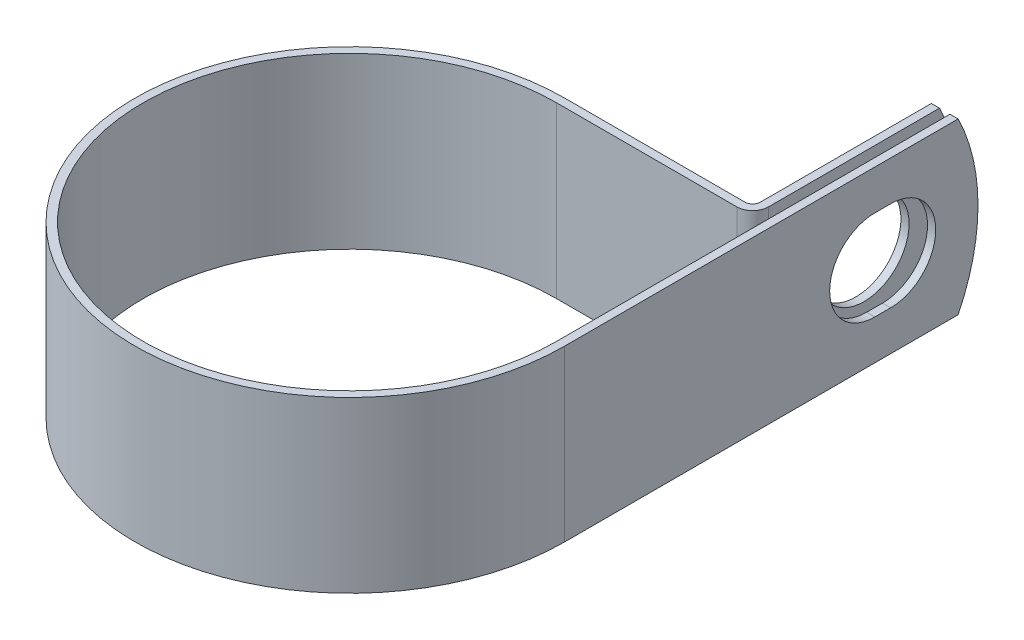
ISO-10303-21;
HEADER;
FILE_DESCRIPTION(('STEP AP214'),'2;1');
FILE_NAME('part.step','',(''),(''),'','','');
FILE_SCHEMA(('AUTOMOTIVE_DESIGN { 1 0 10303 214 1 1 1 1 }'));
ENDSEC;
DATA;
#1=APPLICATION_CONTEXT('core data for automotive mechanical design processes');
#2=APPLICATION_PROTOCOL_DEFINITION('international standard','automotive_design',2000,#1);
#3=PRODUCT_CONTEXT('',#1,'mechanical');
#4=PRODUCT('Part','Part','',(#3));
#5=PRODUCT_RELATED_PRODUCT_CATEGORY('part','',(#4));
#6=PRODUCT_DEFINITION_FORMATION('','',#4);
#7=PRODUCT_DEFINITION_CONTEXT('part definition',#1,'design');
#8=PRODUCT_DEFINITION('design','',#6,#7);
#9=PRODUCT_DEFINITION_SHAPE('','',#8);
#10=(LENGTH_UNIT() NAMED_UNIT(*) SI_UNIT(.MILLI.,.METRE.));
#11=(NAMED_UNIT(*) PLANE_ANGLE_UNIT() SI_UNIT($,.RADIAN.));
#12=(NAMED_UNIT(*) SI_UNIT($,.STERADIAN.) SOLID_ANGLE_UNIT());
#13=UNCERTAINTY_MEASURE_WITH_UNIT(LENGTH_MEASURE(1.E-05),#10,'distance_accuracy_value','');
#14=(GEOMETRIC_REPRESENTATION_CONTEXT(3) GLOBAL_UNCERTAINTY_ASSIGNED_CONTEXT((#13)) GLOBAL_UNIT_ASSIGNED_CONTEXT((#10,
#11,#12)) REPRESENTATION_CONTEXT('',''));
#15=CARTESIAN_POINT('',(0.,0.,0.));
#16=DIRECTION('',(0.,0.,1.));
#17=DIRECTION('',(1.,0.,0.));
#18=AXIS2_PLACEMENT_3D('',#15,#16,#17);
#19=CARTESIAN_POINT('',(30.9499,12.7,0.));
#20=DIRECTION('',(-1.,0.,0.));
#21=DIRECTION('',(0.,0.,1.));
#22=AXIS2_PLACEMENT_3D('',#19,#20,#21);
#23=PLANE('',#22);
#24=DIRECTION('',(0.,0.,-1.));
#25=VECTOR('',#24,1.);
#26=CARTESIAN_POINT('',(30.9499,-6.7437,-46.4311999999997));
#27=LINE('',#26,#25);
#28=CARTESIAN_POINT('',(30.9499,-6.7437,-46.4311999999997));
#29=VERTEX_POINT('',#28);
#30=CARTESIAN_POINT('',(30.9499,-6.7437,-48.8188000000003));
#31=VERTEX_POINT('',#30);
#32=EDGE_CURVE('E236',#29,#31,#27,.T.);
#33=ORIENTED_EDGE('',*,*,#32,.T.);
#34=CARTESIAN_POINT('',(30.9499,0.,-48.8187999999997));
#35=DIRECTION('',(-1.,0.,0.));
#36=DIRECTION('',(0.,0.,1.));
#37=AXIS2_PLACEMENT_3D('',#34,#35,#36);
#38=CIRCLE('',#37,6.7437);
#39=CARTESIAN_POINT('',(30.9499,6.7437,-48.8188000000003));
#40=VERTEX_POINT('',#39);
#41=EDGE_CURVE('E257',#31,#40,#38,.F.);
#42=ORIENTED_EDGE('',*,*,#41,.T.);
#43=DIRECTION('',(0.,0.,1.));
#44=VECTOR('',#43,1.);
#45=CARTESIAN_POINT('',(30.9499,6.7437,-46.4311999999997));
#46=LINE('',#45,#44);
#47=CARTESIAN_POINT('',(30.9499,6.7437,-46.4311999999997));
#48=VERTEX_POINT('',#47);
#49=EDGE_CURVE('E253',#40,#48,#46,.T.);
#50=ORIENTED_EDGE('',*,*,#49,.T.);
#51=CARTESIAN_POINT('',(30.9499,0.,-46.4311999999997));
#52=DIRECTION('',(-1.,0.,0.));
#53=DIRECTION('',(0.,0.,1.));
#54=AXIS2_PLACEMENT_3D('',#51,#52,#53);
#55=CIRCLE('',#54,6.7437);
#56=EDGE_CURVE('E248',#48,#29,#55,.F.);
#57=ORIENTED_EDGE('',*,*,#56,.T.);
#58=EDGE_LOOP('',(#33,#42,#50,#57));
#59=FACE_BOUND('',#58,.T.);
#60=CARTESIAN_POINT('',(30.9499,0.,-33.3248));
#61=DIRECTION('',(-1.,0.,0.));
#62=DIRECTION('',(0.,0.,1.));
#63=AXIS2_PLACEMENT_3D('',#60,#61,#62);
#64=CIRCLE('',#63,28.575);
#65=CARTESIAN_POINT('',(30.9499,12.7,-58.9224683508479));
#66=VERTEX_POINT('',#65);
#67=CARTESIAN_POINT('',(30.9499,-12.7,-58.9224683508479));
#68=VERTEX_POINT('',#67);
#69=EDGE_CURVE('E75',#66,#68,#64,.T.);
#70=ORIENTED_EDGE('',*,*,#69,.T.);
#71=DIRECTION('',(0.,0.,-1.));
#72=VECTOR('',#71,1.);
#73=CARTESIAN_POINT('',(30.9499,-12.7,0.));
#74=LINE('',#73,#72);
#75=CARTESIAN_POINT('',(30.9499,-12.7,0.));
#76=VERTEX_POINT('',#75);
#77=EDGE_CURVE('E271',#76,#68,#74,.T.);
#78=ORIENTED_EDGE('',*,*,#77,.F.);
#79=DIRECTION('',(0.,-1.,0.));
#80=VECTOR('',#79,1.);
#81=CARTESIAN_POINT('',(30.9499,12.7,0.));
#82=LINE('',#81,#80);
#83=CARTESIAN_POINT('',(30.9499,12.7,0.));
#84=VERTEX_POINT('',#83);
#85=EDGE_CURVE('E218',#84,#76,#82,.T.);
#86=ORIENTED_EDGE('',*,*,#85,.F.);
#87=DIRECTION('',(0.,0.,-1.));
#88=VECTOR('',#87,1.);
#89=CARTESIAN_POINT('',(30.9499,12.7,-30.9499));
#90=LINE('',#89,#88);
#91=EDGE_CURVE('E273',#84,#66,#90,.T.);
#92=ORIENTED_EDGE('',*,*,#91,.T.);
#93=EDGE_LOOP('',(#70,#78,#86,#92));
#94=FACE_BOUND('',#93,.T.);
#95=ADVANCED_FACE('F54',(#59,#94),#23,.T.);
#96=CARTESIAN_POINT('',(29.3751,12.7,-61.8998));
#97=DIRECTION('',(1.,0.,0.));
#98=DIRECTION('',(0.,0.,-1.));
#99=AXIS2_PLACEMENT_3D('',#96,#97,#98);
#100=PLANE('',#99);
#101=CARTESIAN_POINT('',(29.3751,0.,-47.625));
#102=DIRECTION('',(1.,0.,0.));
#103=DIRECTION('',(0.,0.,-1.));
#104=AXIS2_PLACEMENT_3D('',#101,#102,#103);
#105=CIRCLE('',#104,6.7437);
#106=CARTESIAN_POINT('',(29.3751,0.,-54.3687));
#107=VERTEX_POINT('',#106);
#108=EDGE_CURVE('E268',#107,#107,#105,.F.);
#109=ORIENTED_EDGE('',*,*,#108,.T.);
#110=EDGE_LOOP('',(#109));
#111=FACE_BOUND('',#110,.T.);
#112=DIRECTION('',(0.,0.,1.));
#113=VECTOR('',#112,1.);
#114=CARTESIAN_POINT('',(29.3751,-12.7,-61.8998));
#115=LINE('',#114,#113);
#116=CARTESIAN_POINT('',(29.3751,-12.7,-58.9224683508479));
#117=VERTEX_POINT('',#116);
#118=CARTESIAN_POINT('',(29.3751,-12.7,-33.32734));
#119=VERTEX_POINT('',#118);
#120=EDGE_CURVE('E184',#117,#119,#115,.T.);
#121=ORIENTED_EDGE('',*,*,#120,.F.);
#122=CARTESIAN_POINT('',(29.3751,0.,-33.3248));
#123=DIRECTION('',(1.,0.,0.));
#124=DIRECTION('',(0.,0.,-1.));
#125=AXIS2_PLACEMENT_3D('',#122,#123,#124);
#126=CIRCLE('',#125,28.575);
#127=CARTESIAN_POINT('',(29.3751,12.7,-58.9224683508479));
#128=VERTEX_POINT('',#127);
#129=EDGE_CURVE('E176',#117,#128,#126,.T.);
#130=ORIENTED_EDGE('',*,*,#129,.T.);
#131=DIRECTION('',(0.,0.,1.));
#132=VECTOR('',#131,1.);
#133=CARTESIAN_POINT('',(29.3751,12.7,-61.8998));
#134=LINE('',#133,#132);
#135=CARTESIAN_POINT('',(29.3751,12.7,-33.32734));
#136=VERTEX_POINT('',#135);
#137=EDGE_CURVE('E224',#128,#136,#134,.T.);
#138=ORIENTED_EDGE('',*,*,#137,.T.);
#139=DIRECTION('',(0.,-1.,0.));
#140=VECTOR('',#139,1.);
#141=CARTESIAN_POINT('',(29.3751,12.7,-33.32734));
#142=LINE('',#141,#140);
#143=EDGE_CURVE('E211',#136,#119,#142,.T.);
#144=ORIENTED_EDGE('',*,*,#143,.T.);
#145=EDGE_LOOP('',(#121,#130,#138,#144));
#146=FACE_BOUND('',#145,.T.);
#147=ADVANCED_FACE('F226',(#111,#146),#100,.T.);
#148=CARTESIAN_POINT('',(28.1559,12.7,-61.8998));
#149=DIRECTION('',(1.,0.,0.));
#150=DIRECTION('',(0.,0.,-1.));
#151=AXIS2_PLACEMENT_3D('',#148,#149,#150);
#152=PLANE('',#151);
#153=CARTESIAN_POINT('',(28.1559,0.,-47.625));
#154=DIRECTION('',(-1.,0.,0.));
#155=DIRECTION('',(0.,0.,1.));
#156=AXIS2_PLACEMENT_3D('',#153,#154,#155);
#157=CIRCLE('',#156,6.7437);
#158=CARTESIAN_POINT('',(28.1559,0.,-40.8813));
#159=VERTEX_POINT('',#158);
#160=EDGE_CURVE('E265',#159,#159,#157,.T.);
#161=ORIENTED_EDGE('',*,*,#160,.F.);
#162=EDGE_LOOP('',(#161));
#163=FACE_BOUND('',#162,.T.);
#164=CARTESIAN_POINT('',(28.1559,0.,-33.3248));
#165=DIRECTION('',(-1.,0.,0.));
#166=DIRECTION('',(0.,0.,1.));
#167=AXIS2_PLACEMENT_3D('',#164,#165,#166);
#168=CIRCLE('',#167,28.575);
#169=CARTESIAN_POINT('',(28.1559,12.7,-58.9224683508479));
#170=VERTEX_POINT('',#169);
#171=CARTESIAN_POINT('',(28.1559,-12.7,-58.9224683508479));
#172=VERTEX_POINT('',#171);
#173=EDGE_CURVE('E67',#170,#172,#168,.T.);
#174=ORIENTED_EDGE('',*,*,#173,.T.);
#175=DIRECTION('',(0.,0.,1.));
#176=VECTOR('',#175,1.);
#177=CARTESIAN_POINT('',(28.1559,-12.7,-61.8998));
#178=LINE('',#177,#176);
#179=CARTESIAN_POINT('',(28.1559,-12.7,-33.32734));
#180=VERTEX_POINT('',#179);
#181=EDGE_CURVE('E167',#172,#180,#178,.T.);
#182=ORIENTED_EDGE('',*,*,#181,.T.);
#183=DIRECTION('',(0.,-1.,0.));
#184=VECTOR('',#183,1.);
#185=CARTESIAN_POINT('',(28.1559,12.7,-33.32734));
#186=LINE('',#185,#184);
#187=CARTESIAN_POINT('',(28.1559,12.7,-33.32734));
#188=VERTEX_POINT('',#187);
#189=EDGE_CURVE('E209',#188,#180,#186,.T.);
#190=ORIENTED_EDGE('',*,*,#189,.F.);
#191=DIRECTION('',(0.,0.,1.));
#192=VECTOR('',#191,1.);
#193=CARTESIAN_POINT('',(28.1559,12.7,-61.8998));
#194=LINE('',#193,#192);
#195=EDGE_CURVE('E169',#170,#188,#194,.T.);
#196=ORIENTED_EDGE('',*,*,#195,.F.);
#197=EDGE_LOOP('',(#174,#182,#190,#196));
#198=FACE_BOUND('',#197,.T.);
#199=ADVANCED_FACE('F164',(#163,#198),#152,.F.);
#200=CARTESIAN_POINT('',(32.1691,12.7,0.));
#201=DIRECTION('',(-1.,0.,0.));
#202=DIRECTION('',(0.,0.,1.));
#203=AXIS2_PLACEMENT_3D('',#200,#201,#202);
#204=PLANE('',#203);
#205=CARTESIAN_POINT('',(32.1691,0.,-48.8187999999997));
#206=DIRECTION('',(1.,0.,0.));
#207=DIRECTION('',(0.,0.,-1.));
#208=AXIS2_PLACEMENT_3D('',#205,#206,#207);
#209=CIRCLE('',#208,6.7437);
#210=CARTESIAN_POINT('',(32.1691,-6.7437,-48.8188000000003));
#211=VERTEX_POINT('',#210);
#212=CARTESIAN_POINT('',(32.1691,6.7437,-48.8188000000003));
#213=VERTEX_POINT('',#212);
#214=EDGE_CURVE('E237',#211,#213,#209,.T.);
#215=ORIENTED_EDGE('',*,*,#214,.F.);
#216=DIRECTION('',(0.,0.,-1.));
#217=VECTOR('',#216,1.);
#218=CARTESIAN_POINT('',(32.1691,-6.7437,-46.4311999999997));
#219=LINE('',#218,#217);
#220=CARTESIAN_POINT('',(32.1691,-6.7437,-46.4311999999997));
#221=VERTEX_POINT('',#220);
#222=EDGE_CURVE('E240',#221,#211,#219,.T.);
#223=ORIENTED_EDGE('',*,*,#222,.F.);
#224=CARTESIAN_POINT('',(32.1691,0.,-46.4311999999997));
#225=DIRECTION('',(1.,0.,0.));
#226=DIRECTION('',(0.,0.,-1.));
#227=AXIS2_PLACEMENT_3D('',#224,#225,#226);
#228=CIRCLE('',#227,6.7437);
#229=CARTESIAN_POINT('',(32.1691,6.7437,-46.4311999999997));
#230=VERTEX_POINT('',#229);
#231=EDGE_CURVE('E230',#230,#221,#228,.T.);
#232=ORIENTED_EDGE('',*,*,#231,.F.);
#233=DIRECTION('',(0.,0.,1.));
#234=VECTOR('',#233,1.);
#235=CARTESIAN_POINT('',(32.1691,6.7437,-46.4311999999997));
#236=LINE('',#235,#234);
#237=EDGE_CURVE('E234',#213,#230,#236,.T.);
#238=ORIENTED_EDGE('',*,*,#237,.F.);
#239=EDGE_LOOP('',(#215,#223,#232,#238));
#240=FACE_BOUND('',#239,.T.);
#241=DIRECTION('',(0.,0.,-1.));
#242=VECTOR('',#241,1.);
#243=CARTESIAN_POINT('',(32.1691,-12.7,0.));
#244=LINE('',#243,#242);
#245=CARTESIAN_POINT('',(32.1691,-12.7,0.));
#246=VERTEX_POINT('',#245);
#247=CARTESIAN_POINT('',(32.1691,-12.7,-58.9224683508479));
#248=VERTEX_POINT('',#247);
#249=EDGE_CURVE('E195',#246,#248,#244,.T.);
#250=ORIENTED_EDGE('',*,*,#249,.T.);
#251=CARTESIAN_POINT('',(32.1691,0.,-33.3248));
#252=DIRECTION('',(-1.,0.,0.));
#253=DIRECTION('',(0.,0.,1.));
#254=AXIS2_PLACEMENT_3D('',#251,#252,#253);
#255=CIRCLE('',#254,28.575);
#256=CARTESIAN_POINT('',(32.1691,12.7,-58.9224683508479));
#257=VERTEX_POINT('',#256);
#258=EDGE_CURVE('E170',#257,#248,#255,.T.);
#259=ORIENTED_EDGE('',*,*,#258,.F.);
#260=DIRECTION('',(0.,0.,-1.));
#261=VECTOR('',#260,1.);
#262=CARTESIAN_POINT('',(32.1691,12.7,-30.9499));
#263=LINE('',#262,#261);
#264=CARTESIAN_POINT('',(32.1691,12.7,0.));
#265=VERTEX_POINT('',#264);
#266=EDGE_CURVE('E198',#265,#257,#263,.T.);
#267=ORIENTED_EDGE('',*,*,#266,.F.);
#268=DIRECTION('',(0.,-1.,0.));
#269=VECTOR('',#268,1.);
#270=CARTESIAN_POINT('',(32.1691,12.7,0.));
#271=LINE('',#270,#269);
#272=EDGE_CURVE('E199',#265,#246,#271,.T.);
#273=ORIENTED_EDGE('',*,*,#272,.T.);
#274=EDGE_LOOP('',(#250,#259,#267,#273));
#275=FACE_BOUND('',#274,.T.);
#276=ADVANCED_FACE('F321',(#240,#275),#204,.F.);
#277=CARTESIAN_POINT('',(0.,-12.7,0.));
#278=DIRECTION('',(0.,1.,0.));
#279=DIRECTION('',(1.,0.,0.));
#280=AXIS2_PLACEMENT_3D('',#277,#278,#279);
#281=PLANE('',#280);
#282=DIRECTION('',(-1.,0.,0.));
#283=VECTOR('',#282,1.);
#284=CARTESIAN_POINT('',(32.1691,-12.7,-58.9224683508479));
#285=LINE('',#284,#283);
#286=EDGE_CURVE('E171',#248,#68,#285,.T.);
#287=ORIENTED_EDGE('',*,*,#286,.F.);
#288=ORIENTED_EDGE('',*,*,#249,.F.);
#289=CARTESIAN_POINT('',(0.,-12.7,0.));
#290=DIRECTION('',(0.,1.,0.));
#291=DIRECTION('',(1.,0.,0.));
#292=AXIS2_PLACEMENT_3D('',#289,#290,#291);
#293=CIRCLE('',#292,32.1691);
#294=CARTESIAN_POINT('',(0.,-12.7,-32.1691));
#295=VERTEX_POINT('',#294);
#296=EDGE_CURVE('E193',#295,#246,#293,.T.);
#297=ORIENTED_EDGE('',*,*,#296,.F.);
#298=DIRECTION('',(1.,0.,0.));
#299=VECTOR('',#298,1.);
#300=CARTESIAN_POINT('',(0.,-12.7,-32.1691));
#301=LINE('',#300,#299);
#302=CARTESIAN_POINT('',(26.99766,-12.7,-32.1691));
#303=VERTEX_POINT('',#302);
#304=EDGE_CURVE('E186',#303,#295,#301,.F.);
#305=ORIENTED_EDGE('',*,*,#304,.F.);
#306=CARTESIAN_POINT('',(26.99766,-12.7,-33.32734));
#307=DIRECTION('',(0.,1.,0.));
#308=DIRECTION('',(1.,0.,0.));
#309=AXIS2_PLACEMENT_3D('',#306,#307,#308);
#310=CIRCLE('',#309,1.15824);
#311=EDGE_CURVE('E183',#180,#303,#310,.F.);
#312=ORIENTED_EDGE('',*,*,#311,.F.);
#313=ORIENTED_EDGE('',*,*,#181,.F.);
#314=DIRECTION('',(-1.,0.,0.));
#315=VECTOR('',#314,1.);
#316=CARTESIAN_POINT('',(32.1691,-12.7,-58.9224683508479));
#317=LINE('',#316,#315);
#318=EDGE_CURVE('E12',#117,#172,#317,.T.);
#319=ORIENTED_EDGE('',*,*,#318,.F.);
#320=ORIENTED_EDGE('',*,*,#120,.T.);
#321=CARTESIAN_POINT('',(26.99766,-12.7,-33.32734));
#322=DIRECTION('',(0.,-1.,0.));
#323=DIRECTION('',(0.,0.,1.));
#324=AXIS2_PLACEMENT_3D('',#321,#322,#323);
#325=CIRCLE('',#324,2.37744);
#326=CARTESIAN_POINT('',(26.99766,-12.7,-30.9499));
#327=VERTEX_POINT('',#326);
#328=EDGE_CURVE('E188',#119,#327,#325,.T.);
#329=ORIENTED_EDGE('',*,*,#328,.T.);
#330=DIRECTION('',(-1.,0.,0.));
#331=VECTOR('',#330,1.);
#332=CARTESIAN_POINT('',(0.,-12.7,-30.9499));
#333=LINE('',#332,#331);
#334=CARTESIAN_POINT('',(0.,-12.7,-30.9499));
#335=VERTEX_POINT('',#334);
#336=EDGE_CURVE('E298',#327,#335,#333,.T.);
#337=ORIENTED_EDGE('',*,*,#336,.T.);
#338=CARTESIAN_POINT('',(0.,-12.7,0.));
#339=DIRECTION('',(0.,1.,0.));
#340=DIRECTION('',(0.,0.,1.));
#341=AXIS2_PLACEMENT_3D('',#338,#339,#340);
#342=CIRCLE('',#341,30.9499);
#343=EDGE_CURVE('E295',#335,#76,#342,.T.);
#344=ORIENTED_EDGE('',*,*,#343,.T.);
#345=ORIENTED_EDGE('',*,*,#77,.T.);
#346=EDGE_LOOP('',(#287,#288,#297,#305,#312,#313,#319,#320,#329,#337,#344,#345));
#347=FACE_BOUND('',#346,.T.);
#348=ADVANCED_FACE('F181',(#347),#281,.F.);
#349=CARTESIAN_POINT('',(0.,12.7,0.));
#350=DIRECTION('',(0.,1.,0.));
#351=DIRECTION('',(1.,0.,0.));
#352=AXIS2_PLACEMENT_3D('',#349,#350,#351);
#353=PLANE('',#352);
#354=ORIENTED_EDGE('',*,*,#266,.T.);
#355=DIRECTION('',(-1.,0.,0.));
#356=VECTOR('',#355,1.);
#357=CARTESIAN_POINT('',(32.1691,12.7,-58.9224683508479));
#358=LINE('',#357,#356);
#359=EDGE_CURVE('E228',#257,#66,#358,.T.);
#360=ORIENTED_EDGE('',*,*,#359,.T.);
#361=ORIENTED_EDGE('',*,*,#91,.F.);
#362=CARTESIAN_POINT('',(0.,12.7,0.));
#363=DIRECTION('',(0.,1.,0.));
#364=DIRECTION('',(0.,0.,1.));
#365=AXIS2_PLACEMENT_3D('',#362,#363,#364);
#366=CIRCLE('',#365,30.9499);
#367=CARTESIAN_POINT('',(0.,12.7,-30.9499));
#368=VERTEX_POINT('',#367);
#369=EDGE_CURVE('E276',#368,#84,#366,.T.);
#370=ORIENTED_EDGE('',*,*,#369,.F.);
#371=DIRECTION('',(-1.,0.,0.));
#372=VECTOR('',#371,1.);
#373=CARTESIAN_POINT('',(0.,12.7,-30.9499));
#374=LINE('',#373,#372);
#375=CARTESIAN_POINT('',(26.99766,12.7,-30.9499));
#376=VERTEX_POINT('',#375);
#377=EDGE_CURVE('E279',#376,#368,#374,.T.);
#378=ORIENTED_EDGE('',*,*,#377,.F.);
#379=CARTESIAN_POINT('',(26.99766,12.7,-33.32734));
#380=DIRECTION('',(0.,-1.,0.));
#381=DIRECTION('',(0.,0.,1.));
#382=AXIS2_PLACEMENT_3D('',#379,#380,#381);
#383=CIRCLE('',#382,2.37744);
#384=EDGE_CURVE('E282',#136,#376,#383,.T.);
#385=ORIENTED_EDGE('',*,*,#384,.F.);
#386=ORIENTED_EDGE('',*,*,#137,.F.);
#387=DIRECTION('',(-1.,0.,0.));
#388=VECTOR('',#387,1.);
#389=CARTESIAN_POINT('',(32.1691,12.7,-58.9224683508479));
#390=LINE('',#389,#388);
#391=EDGE_CURVE('E61',#128,#170,#390,.T.);
#392=ORIENTED_EDGE('',*,*,#391,.T.);
#393=ORIENTED_EDGE('',*,*,#195,.T.);
#394=CARTESIAN_POINT('',(26.99766,12.7,-33.32734));
#395=DIRECTION('',(0.,1.,0.));
#396=DIRECTION('',(1.,0.,0.));
#397=AXIS2_PLACEMENT_3D('',#394,#395,#396);
#398=CIRCLE('',#397,1.15824);
#399=CARTESIAN_POINT('',(26.99766,12.7,-32.1691));
#400=VERTEX_POINT('',#399);
#401=EDGE_CURVE('E287',#188,#400,#398,.F.);
#402=ORIENTED_EDGE('',*,*,#401,.T.);
#403=DIRECTION('',(1.,0.,0.));
#404=VECTOR('',#403,1.);
#405=CARTESIAN_POINT('',(0.,12.7,-32.1691));
#406=LINE('',#405,#404);
#407=CARTESIAN_POINT('',(0.,12.7,-32.1691));
#408=VERTEX_POINT('',#407);
#409=EDGE_CURVE('E289',#400,#408,#406,.F.);
#410=ORIENTED_EDGE('',*,*,#409,.T.);
#411=CARTESIAN_POINT('',(0.,12.7,0.));
#412=DIRECTION('',(0.,1.,0.));
#413=DIRECTION('',(1.,0.,0.));
#414=AXIS2_PLACEMENT_3D('',#411,#412,#413);
#415=CIRCLE('',#414,32.1691);
#416=EDGE_CURVE('E203',#408,#265,#415,.T.);
#417=ORIENTED_EDGE('',*,*,#416,.T.);
#418=EDGE_LOOP('',(#354,#360,#361,#370,#378,#385,#386,#392,#393,#402,#410,#417));
#419=FACE_BOUND('',#418,.T.);
#420=ADVANCED_FACE('F222',(#419),#353,.T.);
#421=CARTESIAN_POINT('',(0.,12.7,0.));
#422=DIRECTION('',(0.,-1.,0.));
#423=DIRECTION('',(0.,0.,-1.));
#424=AXIS2_PLACEMENT_3D('',#421,#422,#423);
#425=CYLINDRICAL_SURFACE('',#424,30.9499);
#426=ORIENTED_EDGE('',*,*,#343,.F.);
#427=DIRECTION('',(0.,-1.,0.));
#428=VECTOR('',#427,1.);
#429=CARTESIAN_POINT('',(0.,12.7,-30.9499));
#430=LINE('',#429,#428);
#431=EDGE_CURVE('E216',#368,#335,#430,.T.);
#432=ORIENTED_EDGE('',*,*,#431,.F.);
#433=ORIENTED_EDGE('',*,*,#369,.T.);
#434=ORIENTED_EDGE('',*,*,#85,.T.);
#435=EDGE_LOOP('',(#426,#432,#433,#434));
#436=FACE_BOUND('',#435,.T.);
#437=ADVANCED_FACE('F311',(#436),#425,.F.);
#438=CARTESIAN_POINT('',(0.,12.7,-30.9499));
#439=DIRECTION('',(0.,0.,1.));
#440=DIRECTION('',(1.,0.,0.));
#441=AXIS2_PLACEMENT_3D('',#438,#439,#440);
#442=PLANE('',#441);
#443=ORIENTED_EDGE('',*,*,#336,.F.);
#444=DIRECTION('',(0.,-1.,0.));
#445=VECTOR('',#444,1.);
#446=CARTESIAN_POINT('',(26.99766,12.7,-30.9499));
#447=LINE('',#446,#445);
#448=EDGE_CURVE('E214',#376,#327,#447,.T.);
#449=ORIENTED_EDGE('',*,*,#448,.F.);
#450=ORIENTED_EDGE('',*,*,#377,.T.);
#451=ORIENTED_EDGE('',*,*,#431,.T.);
#452=EDGE_LOOP('',(#443,#449,#450,#451));
#453=FACE_BOUND('',#452,.T.);
#454=ADVANCED_FACE('F307',(#453),#442,.T.);
#455=CARTESIAN_POINT('',(26.99766,12.7,-33.32734));
#456=DIRECTION('',(0.,-1.,0.));
#457=DIRECTION('',(0.,0.,-1.));
#458=AXIS2_PLACEMENT_3D('',#455,#456,#457);
#459=CYLINDRICAL_SURFACE('',#458,2.37744);
#460=ORIENTED_EDGE('',*,*,#328,.F.);
#461=ORIENTED_EDGE('',*,*,#143,.F.);
#462=ORIENTED_EDGE('',*,*,#384,.T.);
#463=ORIENTED_EDGE('',*,*,#448,.T.);
#464=EDGE_LOOP('',(#460,#461,#462,#463));
#465=FACE_BOUND('',#464,.T.);
#466=ADVANCED_FACE('F304',(#465),#459,.T.);
#467=CARTESIAN_POINT('',(26.99766,12.7,-33.32734));
#468=DIRECTION('',(0.,-1.,0.));
#469=DIRECTION('',(0.,0.,-1.));
#470=AXIS2_PLACEMENT_3D('',#467,#468,#469);
#471=CYLINDRICAL_SURFACE('',#470,1.15824);
#472=ORIENTED_EDGE('',*,*,#311,.T.);
#473=DIRECTION('',(0.,-1.,0.));
#474=VECTOR('',#473,1.);
#475=CARTESIAN_POINT('',(26.99766,12.7,-32.1691));
#476=LINE('',#475,#474);
#477=EDGE_CURVE('E206',#400,#303,#476,.T.);
#478=ORIENTED_EDGE('',*,*,#477,.F.);
#479=ORIENTED_EDGE('',*,*,#401,.F.);
#480=ORIENTED_EDGE('',*,*,#189,.T.);
#481=EDGE_LOOP('',(#472,#478,#479,#480));
#482=FACE_BOUND('',#481,.T.);
#483=ADVANCED_FACE('F334',(#482),#471,.F.);
#484=CARTESIAN_POINT('',(0.,12.7,-32.1691));
#485=DIRECTION('',(0.,0.,1.));
#486=DIRECTION('',(1.,0.,0.));
#487=AXIS2_PLACEMENT_3D('',#484,#485,#486);
#488=PLANE('',#487);
#489=ORIENTED_EDGE('',*,*,#304,.T.);
#490=DIRECTION('',(0.,-1.,0.));
#491=VECTOR('',#490,1.);
#492=CARTESIAN_POINT('',(0.,12.7,-32.1691));
#493=LINE('',#492,#491);
#494=EDGE_CURVE('E202',#408,#295,#493,.T.);
#495=ORIENTED_EDGE('',*,*,#494,.F.);
#496=ORIENTED_EDGE('',*,*,#409,.F.);
#497=ORIENTED_EDGE('',*,*,#477,.T.);
#498=EDGE_LOOP('',(#489,#495,#496,#497));
#499=FACE_BOUND('',#498,.T.);
#500=ADVANCED_FACE('F330',(#499),#488,.F.);
#501=CARTESIAN_POINT('',(0.,12.7,0.));
#502=DIRECTION('',(0.,-1.,0.));
#503=DIRECTION('',(0.,0.,-1.));
#504=AXIS2_PLACEMENT_3D('',#501,#502,#503);
#505=CYLINDRICAL_SURFACE('',#504,32.1691);
#506=ORIENTED_EDGE('',*,*,#296,.T.);
#507=ORIENTED_EDGE('',*,*,#272,.F.);
#508=ORIENTED_EDGE('',*,*,#416,.F.);
#509=ORIENTED_EDGE('',*,*,#494,.T.);
#510=EDGE_LOOP('',(#506,#507,#508,#509));
#511=FACE_BOUND('',#510,.T.);
#512=ADVANCED_FACE('F327',(#511),#505,.T.);
#513=CARTESIAN_POINT('',(48.4491640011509,0.,-47.625));
#514=DIRECTION('',(-1.,0.,0.));
#515=DIRECTION('',(0.,0.,1.));
#516=AXIS2_PLACEMENT_3D('',#513,#514,#515);
#517=CYLINDRICAL_SURFACE('',#516,6.7437);
#518=ORIENTED_EDGE('',*,*,#160,.T.);
#519=EDGE_LOOP('',(#518));
#520=FACE_BOUND('',#519,.T.);
#521=ORIENTED_EDGE('',*,*,#108,.F.);
#522=EDGE_LOOP('',(#521));
#523=FACE_BOUND('',#522,.T.);
#524=ADVANCED_FACE('F379',(#520,#523),#517,.F.);
#525=CARTESIAN_POINT('',(10.1190194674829,-6.7437,-46.4311999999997));
#526=DIRECTION('',(0.,-1.,0.));
#527=DIRECTION('',(0.,0.,-1.));
#528=AXIS2_PLACEMENT_3D('',#525,#526,#527);
#529=PLANE('',#528);
#530=DIRECTION('',(1.,0.,0.));
#531=VECTOR('',#530,1.);
#532=CARTESIAN_POINT('',(10.1190194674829,-6.7437,-46.4311999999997));
#533=LINE('',#532,#531);
#534=EDGE_CURVE('E251',#29,#221,#533,.T.);
#535=ORIENTED_EDGE('',*,*,#534,.T.);
#536=ORIENTED_EDGE('',*,*,#222,.T.);
#537=DIRECTION('',(1.,0.,0.));
#538=VECTOR('',#537,1.);
#539=CARTESIAN_POINT('',(10.1190194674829,-6.7437,-48.8188000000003));
#540=LINE('',#539,#538);
#541=EDGE_CURVE('E247',#31,#211,#540,.T.);
#542=ORIENTED_EDGE('',*,*,#541,.F.);
#543=ORIENTED_EDGE('',*,*,#32,.F.);
#544=EDGE_LOOP('',(#535,#536,#542,#543));
#545=FACE_BOUND('',#544,.T.);
#546=ADVANCED_FACE('F354',(#545),#529,.F.);
#547=CARTESIAN_POINT('',(10.1190194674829,0.,-48.8187999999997));
#548=DIRECTION('',(1.,0.,0.));
#549=DIRECTION('',(0.,0.,-1.));
#550=AXIS2_PLACEMENT_3D('',#547,#548,#549);
#551=CYLINDRICAL_SURFACE('',#550,6.7437);
#552=ORIENTED_EDGE('',*,*,#541,.T.);
#553=ORIENTED_EDGE('',*,*,#214,.T.);
#554=DIRECTION('',(1.,0.,0.));
#555=VECTOR('',#554,1.);
#556=CARTESIAN_POINT('',(10.1190194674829,6.7437,-48.8188000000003));
#557=LINE('',#556,#555);
#558=EDGE_CURVE('E256',#40,#213,#557,.T.);
#559=ORIENTED_EDGE('',*,*,#558,.F.);
#560=ORIENTED_EDGE('',*,*,#41,.F.);
#561=EDGE_LOOP('',(#552,#553,#559,#560));
#562=FACE_BOUND('',#561,.T.);
#563=ADVANCED_FACE('F358',(#562),#551,.F.);
#564=CARTESIAN_POINT('',(10.1190194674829,6.7437,-46.4311999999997));
#565=DIRECTION('',(0.,1.,0.));
#566=DIRECTION('',(0.,0.,1.));
#567=AXIS2_PLACEMENT_3D('',#564,#565,#566);
#568=PLANE('',#567);
#569=ORIENTED_EDGE('',*,*,#558,.T.);
#570=ORIENTED_EDGE('',*,*,#237,.T.);
#571=DIRECTION('',(1.,0.,0.));
#572=VECTOR('',#571,1.);
#573=CARTESIAN_POINT('',(10.1190194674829,6.7437,-46.4311999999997));
#574=LINE('',#573,#572);
#575=EDGE_CURVE('E252',#48,#230,#574,.T.);
#576=ORIENTED_EDGE('',*,*,#575,.F.);
#577=ORIENTED_EDGE('',*,*,#49,.F.);
#578=EDGE_LOOP('',(#569,#570,#576,#577));
#579=FACE_BOUND('',#578,.T.);
#580=ADVANCED_FACE('F362',(#579),#568,.F.);
#581=CARTESIAN_POINT('',(10.1190194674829,0.,-46.4311999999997));
#582=DIRECTION('',(1.,0.,0.));
#583=DIRECTION('',(0.,0.,-1.));
#584=AXIS2_PLACEMENT_3D('',#581,#582,#583);
#585=CYLINDRICAL_SURFACE('',#584,6.7437);
#586=ORIENTED_EDGE('',*,*,#575,.T.);
#587=ORIENTED_EDGE('',*,*,#231,.T.);
#588=ORIENTED_EDGE('',*,*,#534,.F.);
#589=ORIENTED_EDGE('',*,*,#56,.F.);
#590=EDGE_LOOP('',(#586,#587,#588,#589));
#591=FACE_BOUND('',#590,.T.);
#592=ADVANCED_FACE('F366',(#591),#585,.F.);
#593=CARTESIAN_POINT('',(32.1691,0.,-33.3248));
#594=DIRECTION('',(-1.,0.,0.));
#595=DIRECTION('',(0.,0.,1.));
#596=AXIS2_PLACEMENT_3D('',#593,#594,#595);
#597=CYLINDRICAL_SURFACE('',#596,28.575);
#598=ORIENTED_EDGE('',*,*,#129,.F.);
#599=ORIENTED_EDGE('',*,*,#318,.T.);
#600=ORIENTED_EDGE('',*,*,#173,.F.);
#601=ORIENTED_EDGE('',*,*,#391,.F.);
#602=EDGE_LOOP('',(#598,#599,#600,#601));
#603=FACE_BOUND('',#602,.T.);
#604=ADVANCED_FACE('F174',(#603),#597,.T.);
#605=ORIENTED_EDGE('',*,*,#359,.F.);
#606=ORIENTED_EDGE('',*,*,#258,.T.);
#607=ORIENTED_EDGE('',*,*,#286,.T.);
#608=ORIENTED_EDGE('',*,*,#69,.F.);
#609=EDGE_LOOP('',(#605,#606,#607,#608));
#610=FACE_BOUND('',#609,.T.);
#611=ADVANCED_FACE('F316',(#610),#597,.T.);
#612=CLOSED_SHELL('',(#95,#147,#199,#276,#348,#420,#437,#454,#466,#483,#500,#512,#524,#546,#563,
#580,#592,#604,#611));
#613=MANIFOLD_SOLID_BREP('B2',#612);
#614=ADVANCED_BREP_SHAPE_REPRESENTATION('',(#18,#613),#14);
#615=SHAPE_DEFINITION_REPRESENTATION(#9,#614);
ENDSEC;
END-ISO-10303-21;
